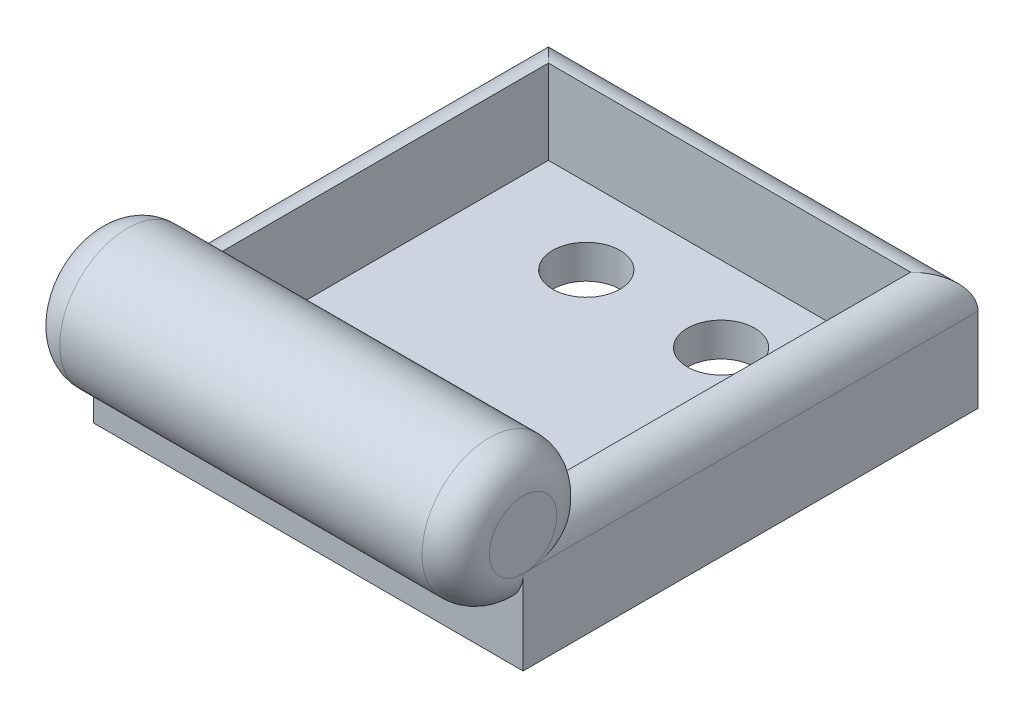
ISO-10303-21;
HEADER;
FILE_DESCRIPTION(('STEP AP214'),'2;1');
FILE_NAME('part.step','',(''),(''),'','','');
FILE_SCHEMA(('AUTOMOTIVE_DESIGN { 1 0 10303 214 1 1 1 1 }'));
ENDSEC;
DATA;
#1=APPLICATION_CONTEXT('core data for automotive mechanical design processes');
#2=APPLICATION_PROTOCOL_DEFINITION('international standard','automotive_design',2000,#1);
#3=PRODUCT_CONTEXT('',#1,'mechanical');
#4=PRODUCT('Part','Part','',(#3));
#5=PRODUCT_RELATED_PRODUCT_CATEGORY('part','',(#4));
#6=PRODUCT_DEFINITION_FORMATION('','',#4);
#7=PRODUCT_DEFINITION_CONTEXT('part definition',#1,'design');
#8=PRODUCT_DEFINITION('design','',#6,#7);
#9=PRODUCT_DEFINITION_SHAPE('','',#8);
#10=(LENGTH_UNIT() NAMED_UNIT(*) SI_UNIT(.MILLI.,.METRE.));
#11=(NAMED_UNIT(*) PLANE_ANGLE_UNIT() SI_UNIT($,.RADIAN.));
#12=(NAMED_UNIT(*) SI_UNIT($,.STERADIAN.) SOLID_ANGLE_UNIT());
#13=UNCERTAINTY_MEASURE_WITH_UNIT(LENGTH_MEASURE(1.E-05),#10,'distance_accuracy_value','');
#14=(GEOMETRIC_REPRESENTATION_CONTEXT(3) GLOBAL_UNCERTAINTY_ASSIGNED_CONTEXT((#13)) GLOBAL_UNIT_ASSIGNED_CONTEXT((#10,
#11,#12)) REPRESENTATION_CONTEXT('',''));
#15=CARTESIAN_POINT('',(0.,0.,0.));
#16=DIRECTION('',(0.,0.,1.));
#17=DIRECTION('',(1.,0.,0.));
#18=AXIS2_PLACEMENT_3D('',#15,#16,#17);
#19=CARTESIAN_POINT('',(12.75,7.,-13.5));
#20=DIRECTION('',(-1.,0.,0.));
#21=DIRECTION('',(0.,0.,1.));
#22=AXIS2_PLACEMENT_3D('',#19,#20,#21);
#23=PLANE('',#22);
#24=CARTESIAN_POINT('',(12.75,7.,13.5));
#25=DIRECTION('',(-1.,0.,0.));
#26=DIRECTION('',(0.,0.,1.));
#27=AXIS2_PLACEMENT_3D('',#24,#25,#26);
#28=CIRCLE('',#27,2.);
#29=CARTESIAN_POINT('',(12.75,5.,13.4999970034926));
#30=VERTEX_POINT('',#29);
#31=EDGE_CURVE('E209',#30,#30,#28,.F.);
#32=ORIENTED_EDGE('',*,*,#31,.T.);
#33=EDGE_LOOP('',(#32));
#34=FACE_BOUND('',#33,.T.);
#35=ADVANCED_FACE('F33',(#34),#23,.F.);
#36=CARTESIAN_POINT('',(-12.75,7.,-13.5));
#37=DIRECTION('',(1.,0.,0.));
#38=DIRECTION('',(0.,0.,-1.));
#39=AXIS2_PLACEMENT_3D('',#36,#37,#38);
#40=PLANE('',#39);
#41=DIRECTION('',(0.,-1.,0.));
#42=VECTOR('',#41,1.);
#43=CARTESIAN_POINT('',(-12.75,7.,13.5));
#44=LINE('',#43,#42);
#45=CARTESIAN_POINT('',(-12.75,5.,13.4999970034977));
#46=VERTEX_POINT('',#45);
#47=CARTESIAN_POINT('',(-12.75,0.,13.5));
#48=VERTEX_POINT('',#47);
#49=EDGE_CURVE('E301',#46,#48,#44,.T.);
#50=ORIENTED_EDGE('',*,*,#49,.F.);
#51=DIRECTION('',(0.,0.,1.));
#52=VECTOR('',#51,1.);
#53=CARTESIAN_POINT('',(-12.75,5.,-13.5));
#54=LINE('',#53,#52);
#55=CARTESIAN_POINT('',(-12.75,5.,-13.5));
#56=VERTEX_POINT('',#55);
#57=EDGE_CURVE('E201',#46,#56,#54,.F.);
#58=ORIENTED_EDGE('',*,*,#57,.T.);
#59=DIRECTION('',(0.,-1.,0.));
#60=VECTOR('',#59,1.);
#61=CARTESIAN_POINT('',(-12.75,7.,-13.5));
#62=LINE('',#61,#60);
#63=CARTESIAN_POINT('',(-12.75,0.,-13.5));
#64=VERTEX_POINT('',#63);
#65=EDGE_CURVE('E303',#56,#64,#62,.T.);
#66=ORIENTED_EDGE('',*,*,#65,.T.);
#67=DIRECTION('',(0.,0.,1.));
#68=VECTOR('',#67,1.);
#69=CARTESIAN_POINT('',(-12.75,0.,-13.5));
#70=LINE('',#69,#68);
#71=EDGE_CURVE('E295',#64,#48,#70,.T.);
#72=ORIENTED_EDGE('',*,*,#71,.T.);
#73=EDGE_LOOP('',(#50,#58,#66,#72));
#74=FACE_BOUND('',#73,.T.);
#75=ADVANCED_FACE('F248',(#74),#40,.F.);
#76=DIRECTION('',(0.,0.,-1.));
#77=VECTOR('',#76,1.);
#78=CARTESIAN_POINT('',(12.75,5.,9.5));
#79=LINE('',#78,#77);
#80=CARTESIAN_POINT('',(12.75,5.,-13.5));
#81=VERTEX_POINT('',#80);
#82=EDGE_CURVE('E206',#81,#30,#79,.F.);
#83=ORIENTED_EDGE('',*,*,#82,.T.);
#84=DIRECTION('',(0.,-1.,0.));
#85=VECTOR('',#84,1.);
#86=CARTESIAN_POINT('',(12.75,7.,13.5));
#87=LINE('',#86,#85);
#88=CARTESIAN_POINT('',(12.75,0.,13.5));
#89=VERTEX_POINT('',#88);
#90=EDGE_CURVE('E53',#30,#89,#87,.T.);
#91=ORIENTED_EDGE('',*,*,#90,.T.);
#92=DIRECTION('',(0.,0.,-1.));
#93=VECTOR('',#92,1.);
#94=CARTESIAN_POINT('',(12.75,0.,-13.5));
#95=LINE('',#94,#93);
#96=CARTESIAN_POINT('',(12.75,0.,-13.5));
#97=VERTEX_POINT('',#96);
#98=EDGE_CURVE('E289',#89,#97,#95,.T.);
#99=ORIENTED_EDGE('',*,*,#98,.T.);
#100=DIRECTION('',(0.,-1.,0.));
#101=VECTOR('',#100,1.);
#102=CARTESIAN_POINT('',(12.75,7.,-13.5));
#103=LINE('',#102,#101);
#104=EDGE_CURVE('E267',#81,#97,#103,.T.);
#105=ORIENTED_EDGE('',*,*,#104,.F.);
#106=EDGE_LOOP('',(#83,#91,#99,#105));
#107=FACE_BOUND('',#106,.T.);
#108=ADVANCED_FACE('F250',(#107),#23,.F.);
#109=CARTESIAN_POINT('',(-12.75,7.,-13.5));
#110=DIRECTION('',(0.,0.,1.));
#111=DIRECTION('',(1.,0.,0.));
#112=AXIS2_PLACEMENT_3D('',#109,#110,#111);
#113=PLANE('',#112);
#114=ORIENTED_EDGE('',*,*,#65,.F.);
#115=DIRECTION('',(-1.,0.,0.));
#116=VECTOR('',#115,1.);
#117=CARTESIAN_POINT('',(12.75,5.,-13.5));
#118=LINE('',#117,#116);
#119=EDGE_CURVE('E61',#56,#81,#118,.F.);
#120=ORIENTED_EDGE('',*,*,#119,.T.);
#121=ORIENTED_EDGE('',*,*,#104,.T.);
#122=DIRECTION('',(-1.,0.,0.));
#123=VECTOR('',#122,1.);
#124=CARTESIAN_POINT('',(-12.75,0.,-13.5));
#125=LINE('',#124,#123);
#126=EDGE_CURVE('E291',#97,#64,#125,.T.);
#127=ORIENTED_EDGE('',*,*,#126,.T.);
#128=EDGE_LOOP('',(#114,#120,#121,#127));
#129=FACE_BOUND('',#128,.T.);
#130=ADVANCED_FACE('F259',(#129),#113,.F.);
#131=CARTESIAN_POINT('',(-12.75,7.,13.5));
#132=DIRECTION('',(1.,0.,0.));
#133=DIRECTION('',(0.,0.,-1.));
#134=AXIS2_PLACEMENT_3D('',#131,#132,#133);
#135=CIRCLE('',#134,2.);
#136=EDGE_CURVE('E203',#46,#46,#135,.F.);
#137=ORIENTED_EDGE('',*,*,#136,.T.);
#138=EDGE_LOOP('',(#137));
#139=FACE_BOUND('',#138,.T.);
#140=ADVANCED_FACE('F256',(#139),#40,.F.);
#141=CARTESIAN_POINT('',(-12.75,7.,13.5));
#142=DIRECTION('',(0.,0.,-1.));
#143=DIRECTION('',(-1.,0.,0.));
#144=AXIS2_PLACEMENT_3D('',#141,#142,#143);
#145=PLANE('',#144);
#146=ORIENTED_EDGE('',*,*,#90,.F.);
#147=CARTESIAN_POINT('',(10.75,5.,13.5));
#148=DIRECTION('',(0.,0.,-1.));
#149=DIRECTION('',(-1.,0.,0.));
#150=AXIS2_PLACEMENT_3D('',#147,#148,#149);
#151=CIRCLE('',#150,2.);
#152=CARTESIAN_POINT('',(10.75,3.,13.5));
#153=VERTEX_POINT('',#152);
#154=EDGE_CURVE('E11',#30,#153,#151,.T.);
#155=ORIENTED_EDGE('',*,*,#154,.T.);
#156=DIRECTION('',(1.,0.,0.));
#157=VECTOR('',#156,1.);
#158=CARTESIAN_POINT('',(-12.75,3.,13.5));
#159=LINE('',#158,#157);
#160=CARTESIAN_POINT('',(-10.75,3.,13.5));
#161=VERTEX_POINT('',#160);
#162=EDGE_CURVE('E413',#153,#161,#159,.F.);
#163=ORIENTED_EDGE('',*,*,#162,.T.);
#164=CARTESIAN_POINT('',(-10.75,5.,13.5));
#165=DIRECTION('',(0.,0.,-1.));
#166=DIRECTION('',(-1.,0.,0.));
#167=AXIS2_PLACEMENT_3D('',#164,#165,#166);
#168=CIRCLE('',#167,2.);
#169=EDGE_CURVE('E46',#161,#46,#168,.T.);
#170=ORIENTED_EDGE('',*,*,#169,.T.);
#171=ORIENTED_EDGE('',*,*,#49,.T.);
#172=DIRECTION('',(1.,0.,0.));
#173=VECTOR('',#172,1.);
#174=CARTESIAN_POINT('',(-12.75,0.,13.5));
#175=LINE('',#174,#173);
#176=EDGE_CURVE('E298',#48,#89,#175,.T.);
#177=ORIENTED_EDGE('',*,*,#176,.T.);
#178=EDGE_LOOP('',(#146,#155,#163,#170,#171,#177));
#179=FACE_BOUND('',#178,.T.);
#180=ADVANCED_FACE('F401',(#179),#145,.F.);
#181=CARTESIAN_POINT('',(0.,0.,0.));
#182=DIRECTION('',(0.,1.,0.));
#183=DIRECTION('',(0.,0.,1.));
#184=AXIS2_PLACEMENT_3D('',#181,#182,#183);
#185=PLANE('',#184);
#186=CARTESIAN_POINT('',(-4.,0.,-7.));
#187=DIRECTION('',(0.,1.,0.));
#188=DIRECTION('',(0.,0.,1.));
#189=AXIS2_PLACEMENT_3D('',#186,#187,#188);
#190=CIRCLE('',#189,2.);
#191=CARTESIAN_POINT('',(-4.,0.,-5.));
#192=VERTEX_POINT('',#191);
#193=EDGE_CURVE('E223',#192,#192,#190,.T.);
#194=ORIENTED_EDGE('',*,*,#193,.T.);
#195=EDGE_LOOP('',(#194));
#196=FACE_BOUND('',#195,.T.);
#197=CARTESIAN_POINT('',(3.99999999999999,0.,-7.));
#198=DIRECTION('',(0.,1.,0.));
#199=DIRECTION('',(0.,0.,-1.));
#200=AXIS2_PLACEMENT_3D('',#197,#198,#199);
#201=CIRCLE('',#200,2.);
#202=CARTESIAN_POINT('',(3.99999999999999,0.,-9.));
#203=VERTEX_POINT('',#202);
#204=EDGE_CURVE('E628',#203,#203,#201,.T.);
#205=ORIENTED_EDGE('',*,*,#204,.T.);
#206=EDGE_LOOP('',(#205));
#207=FACE_BOUND('',#206,.T.);
#208=DIRECTION('',(0.,0.,1.));
#209=VECTOR('',#208,1.);
#210=CARTESIAN_POINT('',(10.5,0.,9.5));
#211=LINE('',#210,#209);
#212=CARTESIAN_POINT('',(10.5,0.,7.5));
#213=VERTEX_POINT('',#212);
#214=CARTESIAN_POINT('',(10.5,0.,9.5));
#215=VERTEX_POINT('',#214);
#216=EDGE_CURVE('E416',#213,#215,#211,.T.);
#217=ORIENTED_EDGE('',*,*,#216,.F.);
#218=CARTESIAN_POINT('',(9.5,0.,7.5));
#219=DIRECTION('',(0.,-1.,0.));
#220=DIRECTION('',(0.,0.,-1.));
#221=AXIS2_PLACEMENT_3D('',#218,#219,#220);
#222=CIRCLE('',#221,1.);
#223=CARTESIAN_POINT('',(9.5,0.,6.5));
#224=VERTEX_POINT('',#223);
#225=EDGE_CURVE('E414',#224,#213,#222,.T.);
#226=ORIENTED_EDGE('',*,*,#225,.F.);
#227=DIRECTION('',(1.,0.,0.));
#228=VECTOR('',#227,1.);
#229=CARTESIAN_POINT('',(-9.5,0.,6.5));
#230=LINE('',#229,#228);
#231=CARTESIAN_POINT('',(-9.5,0.,6.5));
#232=VERTEX_POINT('',#231);
#233=EDGE_CURVE('E367',#232,#224,#230,.T.);
#234=ORIENTED_EDGE('',*,*,#233,.F.);
#235=CARTESIAN_POINT('',(-9.5,0.,7.5));
#236=DIRECTION('',(0.,-1.,0.));
#237=DIRECTION('',(0.,0.,-1.));
#238=AXIS2_PLACEMENT_3D('',#235,#236,#237);
#239=CIRCLE('',#238,1.);
#240=CARTESIAN_POINT('',(-10.5,0.,7.5));
#241=VERTEX_POINT('',#240);
#242=EDGE_CURVE('E334',#241,#232,#239,.T.);
#243=ORIENTED_EDGE('',*,*,#242,.F.);
#244=DIRECTION('',(0.,0.,-1.));
#245=VECTOR('',#244,1.);
#246=CARTESIAN_POINT('',(-10.5,0.,9.5));
#247=LINE('',#246,#245);
#248=CARTESIAN_POINT('',(-10.5,0.,9.5));
#249=VERTEX_POINT('',#248);
#250=EDGE_CURVE('E429',#249,#241,#247,.T.);
#251=ORIENTED_EDGE('',*,*,#250,.F.);
#252=CARTESIAN_POINT('',(-9.5,0.,9.5));
#253=DIRECTION('',(0.,-1.,0.));
#254=DIRECTION('',(0.,0.,-1.));
#255=AXIS2_PLACEMENT_3D('',#252,#253,#254);
#256=CIRCLE('',#255,1.);
#257=CARTESIAN_POINT('',(-9.5,0.,10.5));
#258=VERTEX_POINT('',#257);
#259=EDGE_CURVE('E353',#258,#249,#256,.T.);
#260=ORIENTED_EDGE('',*,*,#259,.F.);
#261=DIRECTION('',(-1.,0.,0.));
#262=VECTOR('',#261,1.);
#263=CARTESIAN_POINT('',(-9.5,0.,10.5));
#264=LINE('',#263,#262);
#265=CARTESIAN_POINT('',(9.5,0.,10.5));
#266=VERTEX_POINT('',#265);
#267=EDGE_CURVE('E425',#266,#258,#264,.T.);
#268=ORIENTED_EDGE('',*,*,#267,.F.);
#269=CARTESIAN_POINT('',(9.5,0.,9.5));
#270=DIRECTION('',(0.,-1.,0.));
#271=DIRECTION('',(0.,0.,1.));
#272=AXIS2_PLACEMENT_3D('',#269,#270,#271);
#273=CIRCLE('',#272,1.);
#274=EDGE_CURVE('E422',#215,#266,#273,.T.);
#275=ORIENTED_EDGE('',*,*,#274,.F.);
#276=EDGE_LOOP('',(#217,#226,#234,#243,#251,#260,#268,#275));
#277=FACE_BOUND('',#276,.T.);
#278=ORIENTED_EDGE('',*,*,#98,.F.);
#279=ORIENTED_EDGE('',*,*,#176,.F.);
#280=ORIENTED_EDGE('',*,*,#71,.F.);
#281=ORIENTED_EDGE('',*,*,#126,.F.);
#282=EDGE_LOOP('',(#278,#279,#280,#281));
#283=FACE_BOUND('',#282,.T.);
#284=ADVANCED_FACE('F389',(#196,#207,#277,#283),#185,.F.);
#285=CARTESIAN_POINT('',(10.75,7.,-13.5));
#286=DIRECTION('',(-1.,0.,0.));
#287=DIRECTION('',(0.,0.,1.));
#288=AXIS2_PLACEMENT_3D('',#285,#286,#287);
#289=PLANE('',#288);
#290=CARTESIAN_POINT('',(10.75,7.,13.5));
#291=DIRECTION('',(-1.,0.,0.));
#292=DIRECTION('',(0.,0.,1.));
#293=AXIS2_PLACEMENT_3D('',#290,#291,#292);
#294=CIRCLE('',#293,4.);
#295=CARTESIAN_POINT('',(10.75,7.,9.5));
#296=VERTEX_POINT('',#295);
#297=CARTESIAN_POINT('',(10.75,3.53589838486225,11.5));
#298=VERTEX_POINT('',#297);
#299=EDGE_CURVE('E186',#296,#298,#294,.T.);
#300=ORIENTED_EDGE('',*,*,#299,.F.);
#301=DIRECTION('',(0.,0.,-1.));
#302=VECTOR('',#301,1.);
#303=CARTESIAN_POINT('',(10.75,7.,-13.5));
#304=LINE('',#303,#302);
#305=CARTESIAN_POINT('',(10.75,7.,-11.5));
#306=VERTEX_POINT('',#305);
#307=EDGE_CURVE('E274',#296,#306,#304,.T.);
#308=ORIENTED_EDGE('',*,*,#307,.T.);
#309=DIRECTION('',(0.,-1.,0.));
#310=VECTOR('',#309,1.);
#311=CARTESIAN_POINT('',(10.75,7.,-11.5));
#312=LINE('',#311,#310);
#313=CARTESIAN_POINT('',(10.75,2.,-11.5));
#314=VERTEX_POINT('',#313);
#315=EDGE_CURVE('E292',#306,#314,#312,.T.);
#316=ORIENTED_EDGE('',*,*,#315,.T.);
#317=DIRECTION('',(0.,0.,-1.));
#318=VECTOR('',#317,1.);
#319=CARTESIAN_POINT('',(10.75,2.,-13.5));
#320=LINE('',#319,#318);
#321=CARTESIAN_POINT('',(10.75,2.,11.5));
#322=VERTEX_POINT('',#321);
#323=EDGE_CURVE('E368',#322,#314,#320,.T.);
#324=ORIENTED_EDGE('',*,*,#323,.F.);
#325=DIRECTION('',(0.,-1.,0.));
#326=VECTOR('',#325,1.);
#327=CARTESIAN_POINT('',(10.75,7.,11.5));
#328=LINE('',#327,#326);
#329=EDGE_CURVE('E175',#298,#322,#328,.T.);
#330=ORIENTED_EDGE('',*,*,#329,.F.);
#331=EDGE_LOOP('',(#300,#308,#316,#324,#330));
#332=FACE_BOUND('',#331,.T.);
#333=ADVANCED_FACE('F380',(#332),#289,.T.);
#334=CARTESIAN_POINT('',(-12.75,7.,-11.5));
#335=DIRECTION('',(0.,0.,1.));
#336=DIRECTION('',(1.,0.,0.));
#337=AXIS2_PLACEMENT_3D('',#334,#335,#336);
#338=PLANE('',#337);
#339=DIRECTION('',(-1.,0.,0.));
#340=VECTOR('',#339,1.);
#341=CARTESIAN_POINT('',(-12.75,2.,-11.5));
#342=LINE('',#341,#340);
#343=CARTESIAN_POINT('',(-10.75,2.,-11.5));
#344=VERTEX_POINT('',#343);
#345=EDGE_CURVE('E371',#314,#344,#342,.T.);
#346=ORIENTED_EDGE('',*,*,#345,.F.);
#347=ORIENTED_EDGE('',*,*,#315,.F.);
#348=DIRECTION('',(-1.,0.,0.));
#349=VECTOR('',#348,1.);
#350=CARTESIAN_POINT('',(-12.75,7.,-11.5));
#351=LINE('',#350,#349);
#352=CARTESIAN_POINT('',(-10.75,7.,-11.5));
#353=VERTEX_POINT('',#352);
#354=EDGE_CURVE('E280',#306,#353,#351,.T.);
#355=ORIENTED_EDGE('',*,*,#354,.T.);
#356=DIRECTION('',(0.,-1.,0.));
#357=VECTOR('',#356,1.);
#358=CARTESIAN_POINT('',(-10.75,7.,-11.5));
#359=LINE('',#358,#357);
#360=EDGE_CURVE('E174',#353,#344,#359,.T.);
#361=ORIENTED_EDGE('',*,*,#360,.T.);
#362=EDGE_LOOP('',(#346,#347,#355,#361));
#363=FACE_BOUND('',#362,.T.);
#364=ADVANCED_FACE('F381',(#363),#338,.T.);
#365=CARTESIAN_POINT('',(-10.75,7.,-13.5));
#366=DIRECTION('',(1.,0.,0.));
#367=DIRECTION('',(0.,0.,-1.));
#368=AXIS2_PLACEMENT_3D('',#365,#366,#367);
#369=PLANE('',#368);
#370=CARTESIAN_POINT('',(-10.75,7.,13.5));
#371=DIRECTION('',(1.,0.,0.));
#372=DIRECTION('',(0.,0.,-1.));
#373=AXIS2_PLACEMENT_3D('',#370,#371,#372);
#374=CIRCLE('',#373,4.);
#375=CARTESIAN_POINT('',(-10.75,3.53589838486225,11.5));
#376=VERTEX_POINT('',#375);
#377=CARTESIAN_POINT('',(-10.75,7.,9.5));
#378=VERTEX_POINT('',#377);
#379=EDGE_CURVE('E178',#376,#378,#374,.T.);
#380=ORIENTED_EDGE('',*,*,#379,.F.);
#381=DIRECTION('',(0.,-1.,0.));
#382=VECTOR('',#381,1.);
#383=CARTESIAN_POINT('',(-10.75,7.,11.5));
#384=LINE('',#383,#382);
#385=CARTESIAN_POINT('',(-10.75,2.,11.5));
#386=VERTEX_POINT('',#385);
#387=EDGE_CURVE('E163',#376,#386,#384,.T.);
#388=ORIENTED_EDGE('',*,*,#387,.T.);
#389=DIRECTION('',(0.,0.,1.));
#390=VECTOR('',#389,1.);
#391=CARTESIAN_POINT('',(-10.75,2.,-13.5));
#392=LINE('',#391,#390);
#393=EDGE_CURVE('E376',#344,#386,#392,.T.);
#394=ORIENTED_EDGE('',*,*,#393,.F.);
#395=ORIENTED_EDGE('',*,*,#360,.F.);
#396=DIRECTION('',(0.,0.,1.));
#397=VECTOR('',#396,1.);
#398=CARTESIAN_POINT('',(-10.75,7.,-13.5));
#399=LINE('',#398,#397);
#400=EDGE_CURVE('E182',#353,#378,#399,.T.);
#401=ORIENTED_EDGE('',*,*,#400,.T.);
#402=EDGE_LOOP('',(#380,#388,#394,#395,#401));
#403=FACE_BOUND('',#402,.T.);
#404=ADVANCED_FACE('F179',(#403),#369,.T.);
#405=CARTESIAN_POINT('',(-12.75,7.,11.5));
#406=DIRECTION('',(0.,0.,-1.));
#407=DIRECTION('',(-1.,0.,0.));
#408=AXIS2_PLACEMENT_3D('',#405,#406,#407);
#409=PLANE('',#408);
#410=DIRECTION('',(1.,0.,0.));
#411=VECTOR('',#410,1.);
#412=CARTESIAN_POINT('',(-12.75,3.53589838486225,11.5));
#413=LINE('',#412,#411);
#414=EDGE_CURVE('E167',#298,#376,#413,.F.);
#415=ORIENTED_EDGE('',*,*,#414,.F.);
#416=ORIENTED_EDGE('',*,*,#329,.T.);
#417=DIRECTION('',(1.,0.,0.));
#418=VECTOR('',#417,1.);
#419=CARTESIAN_POINT('',(-12.75,2.,11.5));
#420=LINE('',#419,#418);
#421=EDGE_CURVE('E170',#386,#322,#420,.T.);
#422=ORIENTED_EDGE('',*,*,#421,.F.);
#423=ORIENTED_EDGE('',*,*,#387,.F.);
#424=EDGE_LOOP('',(#415,#416,#422,#423));
#425=FACE_BOUND('',#424,.T.);
#426=ADVANCED_FACE('F165',(#425),#409,.T.);
#427=CARTESIAN_POINT('',(0.,2.,0.));
#428=DIRECTION('',(0.,1.,0.));
#429=DIRECTION('',(0.,0.,1.));
#430=AXIS2_PLACEMENT_3D('',#427,#428,#429);
#431=PLANE('',#430);
#432=CARTESIAN_POINT('',(-4.,2.,-7.));
#433=DIRECTION('',(0.,1.,0.));
#434=DIRECTION('',(0.,0.,1.));
#435=AXIS2_PLACEMENT_3D('',#432,#433,#434);
#436=CIRCLE('',#435,2.);
#437=CARTESIAN_POINT('',(-4.,2.,-5.));
#438=VERTEX_POINT('',#437);
#439=EDGE_CURVE('E627',#438,#438,#436,.T.);
#440=ORIENTED_EDGE('',*,*,#439,.F.);
#441=EDGE_LOOP('',(#440));
#442=FACE_BOUND('',#441,.T.);
#443=CARTESIAN_POINT('',(3.99999999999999,2.,-7.));
#444=DIRECTION('',(0.,1.,0.));
#445=DIRECTION('',(0.,0.,-1.));
#446=AXIS2_PLACEMENT_3D('',#443,#444,#445);
#447=CIRCLE('',#446,2.);
#448=CARTESIAN_POINT('',(3.99999999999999,2.,-9.));
#449=VERTEX_POINT('',#448);
#450=EDGE_CURVE('E632',#449,#449,#447,.T.);
#451=ORIENTED_EDGE('',*,*,#450,.F.);
#452=EDGE_LOOP('',(#451));
#453=FACE_BOUND('',#452,.T.);
#454=CARTESIAN_POINT('',(9.5,2.,7.5));
#455=DIRECTION('',(0.,1.,0.));
#456=DIRECTION('',(0.,0.,1.));
#457=AXIS2_PLACEMENT_3D('',#454,#455,#456);
#458=CIRCLE('',#457,1.);
#459=CARTESIAN_POINT('',(10.5,2.,7.5));
#460=VERTEX_POINT('',#459);
#461=CARTESIAN_POINT('',(9.5,2.,6.5));
#462=VERTEX_POINT('',#461);
#463=EDGE_CURVE('E192',#460,#462,#458,.T.);
#464=ORIENTED_EDGE('',*,*,#463,.F.);
#465=DIRECTION('',(0.,0.,-1.));
#466=VECTOR('',#465,1.);
#467=CARTESIAN_POINT('',(10.5,2.,0.));
#468=LINE('',#467,#466);
#469=CARTESIAN_POINT('',(10.5,2.,9.5));
#470=VERTEX_POINT('',#469);
#471=EDGE_CURVE('E306',#470,#460,#468,.T.);
#472=ORIENTED_EDGE('',*,*,#471,.F.);
#473=CARTESIAN_POINT('',(9.5,2.,9.5));
#474=DIRECTION('',(0.,1.,0.));
#475=DIRECTION('',(0.,0.,1.));
#476=AXIS2_PLACEMENT_3D('',#473,#474,#475);
#477=CIRCLE('',#476,1.);
#478=CARTESIAN_POINT('',(9.5,2.,10.5));
#479=VERTEX_POINT('',#478);
#480=EDGE_CURVE('E308',#479,#470,#477,.T.);
#481=ORIENTED_EDGE('',*,*,#480,.F.);
#482=DIRECTION('',(1.,0.,0.));
#483=VECTOR('',#482,1.);
#484=CARTESIAN_POINT('',(0.,2.,10.5));
#485=LINE('',#484,#483);
#486=CARTESIAN_POINT('',(-9.5,2.,10.5));
#487=VERTEX_POINT('',#486);
#488=EDGE_CURVE('E311',#487,#479,#485,.T.);
#489=ORIENTED_EDGE('',*,*,#488,.F.);
#490=CARTESIAN_POINT('',(-9.5,2.,9.5));
#491=DIRECTION('',(0.,1.,0.));
#492=DIRECTION('',(0.,0.,1.));
#493=AXIS2_PLACEMENT_3D('',#490,#491,#492);
#494=CIRCLE('',#493,1.);
#495=CARTESIAN_POINT('',(-10.5,2.,9.5));
#496=VERTEX_POINT('',#495);
#497=EDGE_CURVE('E313',#496,#487,#494,.T.);
#498=ORIENTED_EDGE('',*,*,#497,.F.);
#499=DIRECTION('',(0.,0.,1.));
#500=VECTOR('',#499,1.);
#501=CARTESIAN_POINT('',(-10.5,2.,0.));
#502=LINE('',#501,#500);
#503=CARTESIAN_POINT('',(-10.5,2.,7.5));
#504=VERTEX_POINT('',#503);
#505=EDGE_CURVE('E315',#504,#496,#502,.T.);
#506=ORIENTED_EDGE('',*,*,#505,.F.);
#507=CARTESIAN_POINT('',(-9.5,2.,7.5));
#508=DIRECTION('',(0.,1.,0.));
#509=DIRECTION('',(0.,0.,1.));
#510=AXIS2_PLACEMENT_3D('',#507,#508,#509);
#511=CIRCLE('',#510,1.);
#512=CARTESIAN_POINT('',(-9.5,2.,6.5));
#513=VERTEX_POINT('',#512);
#514=EDGE_CURVE('E317',#513,#504,#511,.T.);
#515=ORIENTED_EDGE('',*,*,#514,.F.);
#516=DIRECTION('',(-1.,0.,0.));
#517=VECTOR('',#516,1.);
#518=CARTESIAN_POINT('',(0.,2.,6.5));
#519=LINE('',#518,#517);
#520=EDGE_CURVE('E196',#462,#513,#519,.T.);
#521=ORIENTED_EDGE('',*,*,#520,.F.);
#522=EDGE_LOOP('',(#464,#472,#481,#489,#498,#506,#515,#521));
#523=FACE_BOUND('',#522,.T.);
#524=ORIENTED_EDGE('',*,*,#323,.T.);
#525=ORIENTED_EDGE('',*,*,#345,.T.);
#526=ORIENTED_EDGE('',*,*,#393,.T.);
#527=ORIENTED_EDGE('',*,*,#421,.T.);
#528=EDGE_LOOP('',(#524,#525,#526,#527));
#529=FACE_BOUND('',#528,.T.);
#530=ADVANCED_FACE('F339',(#442,#453,#523,#529),#431,.T.);
#531=CARTESIAN_POINT('',(9.5,7.,7.5));
#532=DIRECTION('',(0.,-1.,0.));
#533=DIRECTION('',(0.,0.,-1.));
#534=AXIS2_PLACEMENT_3D('',#531,#532,#533);
#535=CYLINDRICAL_SURFACE('',#534,1.);
#536=ORIENTED_EDGE('',*,*,#463,.T.);
#537=DIRECTION('',(0.,-1.,0.));
#538=VECTOR('',#537,1.);
#539=CARTESIAN_POINT('',(9.5,7.,6.5));
#540=LINE('',#539,#538);
#541=EDGE_CURVE('E326',#462,#224,#540,.T.);
#542=ORIENTED_EDGE('',*,*,#541,.T.);
#543=ORIENTED_EDGE('',*,*,#225,.T.);
#544=DIRECTION('',(0.,-1.,0.));
#545=VECTOR('',#544,1.);
#546=CARTESIAN_POINT('',(10.5,7.,7.5));
#547=LINE('',#546,#545);
#548=EDGE_CURVE('E364',#460,#213,#547,.T.);
#549=ORIENTED_EDGE('',*,*,#548,.F.);
#550=EDGE_LOOP('',(#536,#542,#543,#549));
#551=FACE_BOUND('',#550,.T.);
#552=ADVANCED_FACE('F397',(#551),#535,.F.);
#553=CARTESIAN_POINT('',(-9.5,7.,6.5));
#554=DIRECTION('',(0.,0.,-1.));
#555=DIRECTION('',(-1.,0.,0.));
#556=AXIS2_PLACEMENT_3D('',#553,#554,#555);
#557=PLANE('',#556);
#558=ORIENTED_EDGE('',*,*,#520,.T.);
#559=DIRECTION('',(0.,-1.,0.));
#560=VECTOR('',#559,1.);
#561=CARTESIAN_POINT('',(-9.5,7.,6.5));
#562=LINE('',#561,#560);
#563=EDGE_CURVE('E324',#513,#232,#562,.T.);
#564=ORIENTED_EDGE('',*,*,#563,.T.);
#565=ORIENTED_EDGE('',*,*,#233,.T.);
#566=ORIENTED_EDGE('',*,*,#541,.F.);
#567=EDGE_LOOP('',(#558,#564,#565,#566));
#568=FACE_BOUND('',#567,.T.);
#569=ADVANCED_FACE('F322',(#568),#557,.F.);
#570=CARTESIAN_POINT('',(-9.5,7.,7.5));
#571=DIRECTION('',(0.,-1.,0.));
#572=DIRECTION('',(0.,0.,-1.));
#573=AXIS2_PLACEMENT_3D('',#570,#571,#572);
#574=CYLINDRICAL_SURFACE('',#573,1.);
#575=ORIENTED_EDGE('',*,*,#514,.T.);
#576=DIRECTION('',(0.,-1.,0.));
#577=VECTOR('',#576,1.);
#578=CARTESIAN_POINT('',(-10.5,7.,7.5));
#579=LINE('',#578,#577);
#580=EDGE_CURVE('E336',#504,#241,#579,.T.);
#581=ORIENTED_EDGE('',*,*,#580,.T.);
#582=ORIENTED_EDGE('',*,*,#242,.T.);
#583=ORIENTED_EDGE('',*,*,#563,.F.);
#584=EDGE_LOOP('',(#575,#581,#582,#583));
#585=FACE_BOUND('',#584,.T.);
#586=ADVANCED_FACE('F331',(#585),#574,.F.);
#587=CARTESIAN_POINT('',(-10.5,7.,9.5));
#588=DIRECTION('',(-1.,0.,0.));
#589=DIRECTION('',(0.,0.,1.));
#590=AXIS2_PLACEMENT_3D('',#587,#588,#589);
#591=PLANE('',#590);
#592=ORIENTED_EDGE('',*,*,#505,.T.);
#593=DIRECTION('',(0.,-1.,0.));
#594=VECTOR('',#593,1.);
#595=CARTESIAN_POINT('',(-10.5,7.,9.5));
#596=LINE('',#595,#594);
#597=EDGE_CURVE('E347',#496,#249,#596,.T.);
#598=ORIENTED_EDGE('',*,*,#597,.T.);
#599=ORIENTED_EDGE('',*,*,#250,.T.);
#600=ORIENTED_EDGE('',*,*,#580,.F.);
#601=EDGE_LOOP('',(#592,#598,#599,#600));
#602=FACE_BOUND('',#601,.T.);
#603=ADVANCED_FACE('F345',(#602),#591,.F.);
#604=CARTESIAN_POINT('',(-9.5,7.,9.5));
#605=DIRECTION('',(0.,-1.,0.));
#606=DIRECTION('',(0.,0.,-1.));
#607=AXIS2_PLACEMENT_3D('',#604,#605,#606);
#608=CYLINDRICAL_SURFACE('',#607,1.);
#609=ORIENTED_EDGE('',*,*,#497,.T.);
#610=DIRECTION('',(0.,-1.,0.));
#611=VECTOR('',#610,1.);
#612=CARTESIAN_POINT('',(-9.5,7.,10.5));
#613=LINE('',#612,#611);
#614=EDGE_CURVE('E355',#487,#258,#613,.T.);
#615=ORIENTED_EDGE('',*,*,#614,.T.);
#616=ORIENTED_EDGE('',*,*,#259,.T.);
#617=ORIENTED_EDGE('',*,*,#597,.F.);
#618=EDGE_LOOP('',(#609,#615,#616,#617));
#619=FACE_BOUND('',#618,.T.);
#620=ADVANCED_FACE('F350',(#619),#608,.F.);
#621=CARTESIAN_POINT('',(-9.5,7.,10.5));
#622=DIRECTION('',(0.,0.,1.));
#623=DIRECTION('',(1.,0.,0.));
#624=AXIS2_PLACEMENT_3D('',#621,#622,#623);
#625=PLANE('',#624);
#626=ORIENTED_EDGE('',*,*,#488,.T.);
#627=DIRECTION('',(0.,-1.,0.));
#628=VECTOR('',#627,1.);
#629=CARTESIAN_POINT('',(9.5,7.,10.5));
#630=LINE('',#629,#628);
#631=EDGE_CURVE('E358',#479,#266,#630,.T.);
#632=ORIENTED_EDGE('',*,*,#631,.T.);
#633=ORIENTED_EDGE('',*,*,#267,.T.);
#634=ORIENTED_EDGE('',*,*,#614,.F.);
#635=EDGE_LOOP('',(#626,#632,#633,#634));
#636=FACE_BOUND('',#635,.T.);
#637=ADVANCED_FACE('F448',(#636),#625,.F.);
#638=CARTESIAN_POINT('',(9.5,7.,9.5));
#639=DIRECTION('',(0.,-1.,0.));
#640=DIRECTION('',(0.,0.,-1.));
#641=AXIS2_PLACEMENT_3D('',#638,#639,#640);
#642=CYLINDRICAL_SURFACE('',#641,1.);
#643=ORIENTED_EDGE('',*,*,#480,.T.);
#644=DIRECTION('',(0.,-1.,0.));
#645=VECTOR('',#644,1.);
#646=CARTESIAN_POINT('',(10.5,7.,9.5));
#647=LINE('',#646,#645);
#648=EDGE_CURVE('E362',#470,#215,#647,.T.);
#649=ORIENTED_EDGE('',*,*,#648,.T.);
#650=ORIENTED_EDGE('',*,*,#274,.T.);
#651=ORIENTED_EDGE('',*,*,#631,.F.);
#652=EDGE_LOOP('',(#643,#649,#650,#651));
#653=FACE_BOUND('',#652,.T.);
#654=ADVANCED_FACE('F446',(#653),#642,.F.);
#655=CARTESIAN_POINT('',(10.5,7.,9.5));
#656=DIRECTION('',(1.,0.,0.));
#657=DIRECTION('',(0.,0.,-1.));
#658=AXIS2_PLACEMENT_3D('',#655,#656,#657);
#659=PLANE('',#658);
#660=ORIENTED_EDGE('',*,*,#471,.T.);
#661=ORIENTED_EDGE('',*,*,#548,.T.);
#662=ORIENTED_EDGE('',*,*,#216,.T.);
#663=ORIENTED_EDGE('',*,*,#648,.F.);
#664=EDGE_LOOP('',(#660,#661,#662,#663));
#665=FACE_BOUND('',#664,.T.);
#666=ADVANCED_FACE('F244',(#665),#659,.F.);
#667=CARTESIAN_POINT('',(-12.75,7.,13.5));
#668=DIRECTION('',(1.,0.,0.));
#669=DIRECTION('',(0.,0.,-1.));
#670=AXIS2_PLACEMENT_3D('',#667,#668,#669);
#671=CYLINDRICAL_SURFACE('',#670,4.);
#672=ORIENTED_EDGE('',*,*,#379,.T.);
#673=CARTESIAN_POINT('',(-10.75,7.,13.5));
#674=DIRECTION('',(1.,0.,0.));
#675=DIRECTION('',(0.,0.,-1.));
#676=AXIS2_PLACEMENT_3D('',#673,#674,#675);
#677=CIRCLE('',#676,4.);
#678=EDGE_CURVE('E194',#378,#161,#677,.T.);
#679=ORIENTED_EDGE('',*,*,#678,.T.);
#680=ORIENTED_EDGE('',*,*,#162,.F.);
#681=CARTESIAN_POINT('',(10.75,7.,13.5));
#682=DIRECTION('',(-1.,0.,0.));
#683=DIRECTION('',(0.,0.,1.));
#684=AXIS2_PLACEMENT_3D('',#681,#682,#683);
#685=CIRCLE('',#684,4.);
#686=EDGE_CURVE('E191',#153,#296,#685,.T.);
#687=ORIENTED_EDGE('',*,*,#686,.T.);
#688=ORIENTED_EDGE('',*,*,#299,.T.);
#689=ORIENTED_EDGE('',*,*,#414,.T.);
#690=EDGE_LOOP('',(#672,#679,#680,#687,#688,#689));
#691=FACE_BOUND('',#690,.T.);
#692=ADVANCED_FACE('F189',(#691),#671,.T.);
#693=CARTESIAN_POINT('',(10.75,7.,13.5));
#694=DIRECTION('',(-1.,0.,0.));
#695=DIRECTION('',(0.,0.,1.));
#696=AXIS2_PLACEMENT_3D('',#693,#694,#695);
#697=TOROIDAL_SURFACE('',#696,2.,2.);
#698=ORIENTED_EDGE('',*,*,#154,.F.);
#699=ORIENTED_EDGE('',*,*,#31,.F.);
#700=CARTESIAN_POINT('',(10.75,7.,9.5));
#701=CARTESIAN_POINT('',(10.7937931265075,7.00001030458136,9.49999289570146));
#702=CARTESIAN_POINT('',(10.837579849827,6.99856193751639,9.50143813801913));
#703=CARTESIAN_POINT('',(10.92475455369,6.9928263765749,9.50717818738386));
#704=CARTESIAN_POINT('',(10.9681427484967,6.98854081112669,9.51147135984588));
#705=CARTESIAN_POINT('',(11.0538857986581,6.97724867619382,9.52281261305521));
#706=CARTESIAN_POINT('',(11.0962457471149,6.97026127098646,9.52984129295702));
#707=CARTESIAN_POINT('',(11.1799178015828,6.95371249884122,9.54654966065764));
#708=CARTESIAN_POINT('',(11.2212298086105,6.94415088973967,9.55622959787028));
#709=CARTESIAN_POINT('',(11.3429995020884,6.9119021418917,9.58902843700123));
#710=CARTESIAN_POINT('',(11.4215389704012,6.88561698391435,9.61594002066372));
#711=CARTESIAN_POINT('',(11.5717520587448,6.82518912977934,9.6786788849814));
#712=CARTESIAN_POINT('',(11.6434136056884,6.79103296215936,9.71452145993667));
#713=CARTESIAN_POINT('',(11.8009830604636,6.70467058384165,9.8067476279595));
#714=CARTESIAN_POINT('',(11.8839636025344,6.65020434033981,9.86602218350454));
#715=CARTESIAN_POINT('',(12.0358401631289,6.53484665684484,9.99529334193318));
#716=CARTESIAN_POINT('',(12.1047143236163,6.47394546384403,10.0653062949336));
#717=CARTESIAN_POINT('',(12.2531674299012,6.32492472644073,10.2427041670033));
#718=CARTESIAN_POINT('',(12.3265627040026,6.23539803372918,10.3540618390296));
#719=CARTESIAN_POINT('',(12.4511417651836,6.05734127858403,10.589220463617));
#720=CARTESIAN_POINT('',(12.5022819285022,5.9688135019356,10.7130452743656));
#721=CARTESIAN_POINT('',(12.5999149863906,5.7704679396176,11.0115247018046));
#722=CARTESIAN_POINT('',(12.6397317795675,5.66285745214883,11.1898013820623));
#723=CARTESIAN_POINT('',(12.697540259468,5.46645352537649,11.5594368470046));
#724=CARTESIAN_POINT('',(12.7155422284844,5.37765123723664,11.7507894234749));
#725=CARTESIAN_POINT('',(12.7329145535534,5.26362199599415,12.0445040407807));
#726=CARTESIAN_POINT('',(12.7371028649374,5.22893300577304,12.143019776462));
#727=CARTESIAN_POINT('',(12.7433217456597,5.16631365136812,12.3422344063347));
#728=CARTESIAN_POINT('',(12.745352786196,5.13838181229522,12.4429328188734));
#729=CARTESIAN_POINT('',(12.7484425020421,5.08440234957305,12.6689305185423));
#730=CARTESIAN_POINT('',(12.7491807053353,5.06018405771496,12.7946795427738));
#731=CARTESIAN_POINT('',(12.7497997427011,5.03042579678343,13.0003302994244));
#732=CARTESIAN_POINT('',(12.7498983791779,5.02128698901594,13.0797255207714));
#733=CARTESIAN_POINT('',(12.7499773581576,5.01036042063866,13.2080154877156));
#734=CARTESIAN_POINT('',(12.7499887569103,5.00709620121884,13.2567864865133));
#735=CARTESIAN_POINT('',(12.7499994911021,5.0026005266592,13.3492922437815));
#736=CARTESIAN_POINT('',(12.7499999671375,5.00119167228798,13.3930183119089));
#737=CARTESIAN_POINT('',(12.7499999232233,5.00016661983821,13.4578348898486));
#738=CARTESIAN_POINT('',(12.7499997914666,4.99999985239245,13.4789176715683));
#739=CARTESIAN_POINT('',(12.75,5.,13.5));
#740=B_SPLINE_CURVE_WITH_KNOTS('',3,(#700,#701,#702,#703,#704,#705,#706,#707,#708,#709,#710,
#711,#712,#713,#714,#715,#716,#717,#718,#719,#720,#721,#722,#723,#724,#725,#726,#727,#728,#729,
#730,#731,#732,#733,#734,#735,#736,#737,#738,#739),.UNSPECIFIED.,.F.,.F.,(4,2,2,2,2,2,2,2,2,2,2,
2,2,2,2,2,2,2,2,4),(0.,0.131321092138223,0.262566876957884,0.392898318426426,0.523242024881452,
0.78318155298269,1.04356932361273,1.3884878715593,1.73393689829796,2.21316555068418,
2.69332938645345,3.32653080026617,3.95943364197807,4.27280047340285,4.58609884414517,
4.96970128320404,5.20932794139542,5.35593744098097,5.48715870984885,5.5504062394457),.UNSPECIFIED.);
#741=EDGE_CURVE('E38',#296,#30,#740,.T.);
#742=ORIENTED_EDGE('',*,*,#741,.F.);
#743=ORIENTED_EDGE('',*,*,#686,.F.);
#744=EDGE_LOOP('',(#698,#699,#742,#743));
#745=FACE_BOUND('',#744,.T.);
#746=ADVANCED_FACE('F235',(#745),#697,.T.);
#747=CARTESIAN_POINT('',(10.75,5.,0.));
#748=DIRECTION('',(0.,0.,1.));
#749=DIRECTION('',(1.,0.,0.));
#750=AXIS2_PLACEMENT_3D('',#747,#748,#749);
#751=CYLINDRICAL_SURFACE('',#750,2.);
#752=ORIENTED_EDGE('',*,*,#741,.T.);
#753=ORIENTED_EDGE('',*,*,#82,.F.);
#754=CARTESIAN_POINT('',(10.75,5.,-11.5));
#755=DIRECTION('',(0.707106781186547,0.,0.707106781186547));
#756=DIRECTION('',(-0.707106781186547,0.,0.707106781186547));
#757=AXIS2_PLACEMENT_3D('',#754,#755,#756);
#758=ELLIPSE('',#757,2.82842712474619,2.);
#759=EDGE_CURVE('E275',#306,#81,#758,.F.);
#760=ORIENTED_EDGE('',*,*,#759,.F.);
#761=ORIENTED_EDGE('',*,*,#307,.F.);
#762=EDGE_LOOP('',(#752,#753,#760,#761));
#763=FACE_BOUND('',#762,.T.);
#764=ADVANCED_FACE('F35',(#763),#751,.T.);
#765=CARTESIAN_POINT('',(0.,5.,-11.5));
#766=DIRECTION('',(1.,0.,0.));
#767=DIRECTION('',(0.,0.,-1.));
#768=AXIS2_PLACEMENT_3D('',#765,#766,#767);
#769=CYLINDRICAL_SURFACE('',#768,2.);
#770=ORIENTED_EDGE('',*,*,#759,.T.);
#771=ORIENTED_EDGE('',*,*,#119,.F.);
#772=CARTESIAN_POINT('',(-10.75,5.,-11.5));
#773=DIRECTION('',(0.707106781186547,0.,-0.707106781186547));
#774=DIRECTION('',(-0.707106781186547,0.,-0.707106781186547));
#775=AXIS2_PLACEMENT_3D('',#772,#773,#774);
#776=ELLIPSE('',#775,2.82842712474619,2.);
#777=EDGE_CURVE('E222',#353,#56,#776,.F.);
#778=ORIENTED_EDGE('',*,*,#777,.F.);
#779=ORIENTED_EDGE('',*,*,#354,.F.);
#780=EDGE_LOOP('',(#770,#771,#778,#779));
#781=FACE_BOUND('',#780,.T.);
#782=ADVANCED_FACE('F231',(#781),#769,.T.);
#783=CARTESIAN_POINT('',(-10.75,5.,0.));
#784=DIRECTION('',(0.,0.,-1.));
#785=DIRECTION('',(-1.,0.,0.));
#786=AXIS2_PLACEMENT_3D('',#783,#784,#785);
#787=CYLINDRICAL_SURFACE('',#786,2.);
#788=ORIENTED_EDGE('',*,*,#777,.T.);
#789=ORIENTED_EDGE('',*,*,#57,.F.);
#790=CARTESIAN_POINT('',(-12.75,5.,13.5));
#791=CARTESIAN_POINT('',(-12.7499997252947,4.99999978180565,13.4789178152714));
#792=CARTESIAN_POINT('',(-12.7499998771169,5.00016656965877,13.4578350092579));
#793=CARTESIAN_POINT('',(-12.7500000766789,5.00126853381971,13.3881652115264));
#794=CARTESIAN_POINT('',(-12.7499997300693,5.0029223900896,13.3395878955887));
#795=CARTESIAN_POINT('',(-12.7499835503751,5.00863813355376,13.2301532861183));
#796=CARTESIAN_POINT('',(-12.7499637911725,5.01320648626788,13.1693230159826));
#797=CARTESIAN_POINT('',(-12.7497970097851,5.03107576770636,12.9867349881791));
#798=CARTESIAN_POINT('',(-12.7495417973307,5.04853747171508,12.865359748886));
#799=CARTESIAN_POINT('',(-12.7479176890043,5.09400248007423,12.6244616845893));
#800=CARTESIAN_POINT('',(-12.7465471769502,5.12202105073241,12.5049418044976));
#801=CARTESIAN_POINT('',(-12.7414059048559,5.18818909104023,12.2671973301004));
#802=CARTESIAN_POINT('',(-12.7376058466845,5.22645886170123,12.1490067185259));
#803=CARTESIAN_POINT('',(-12.7259999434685,5.31189895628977,11.9160784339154));
#804=CARTESIAN_POINT('',(-12.7181917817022,5.35907441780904,11.8013427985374));
#805=CARTESIAN_POINT('',(-12.686093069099,5.51230561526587,11.4630796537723));
#806=CARTESIAN_POINT('',(-12.6531294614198,5.63011344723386,11.2453349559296));
#807=CARTESIAN_POINT('',(-12.5664893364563,5.84182428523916,10.901240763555));
#808=CARTESIAN_POINT('',(-12.5235450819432,5.93039307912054,10.7688309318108));
#809=CARTESIAN_POINT('',(-12.4161832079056,6.11124092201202,10.5157386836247));
#810=CARTESIAN_POINT('',(-12.3518092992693,6.20351208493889,10.3950330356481));
#811=CARTESIAN_POINT('',(-12.2175905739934,6.36159229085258,10.1985236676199));
#812=CARTESIAN_POINT('',(-12.1535865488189,6.42800694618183,10.1192360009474));
#813=CARTESIAN_POINT('',(-12.0102741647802,6.55592438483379,9.97114017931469));
#814=CARTESIAN_POINT('',(-11.9309873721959,6.61743391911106,9.90231749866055));
#815=CARTESIAN_POINT('',(-11.775350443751,6.71911590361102,9.79118099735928));
#816=CARTESIAN_POINT('',(-11.701963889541,6.76104379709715,9.74634247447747));
#817=CARTESIAN_POINT('',(-11.5460853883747,6.83677828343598,9.66648721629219));
#818=CARTESIAN_POINT('',(-11.463592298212,6.87058385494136,9.63147171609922));
#819=CARTESIAN_POINT('',(-11.2902059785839,6.92783553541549,9.57271462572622));
#820=CARTESIAN_POINT('',(-11.199242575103,6.95118367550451,9.54907950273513));
#821=CARTESIAN_POINT('',(-11.0594741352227,6.97648235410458,9.52357900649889));
#822=CARTESIAN_POINT('',(-11.0123724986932,6.98329297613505,9.51673914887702));
#823=CARTESIAN_POINT('',(-10.9174462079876,6.99354696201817,9.5064545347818));
#824=CARTESIAN_POINT('',(-10.8696220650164,6.99699260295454,9.5030074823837));
#825=CARTESIAN_POINT('',(-10.7978084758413,6.99957274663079,9.50042752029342));
#826=CARTESIAN_POINT('',(-10.7739012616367,7.0000029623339,9.4999977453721));
#827=CARTESIAN_POINT('',(-10.75,7.,9.5));
#828=B_SPLINE_CURVE_WITH_KNOTS('',3,(#790,#791,#792,#793,#794,#795,#796,#797,#798,#799,#800,
#801,#802,#803,#804,#805,#806,#807,#808,#809,#810,#811,#812,#813,#814,#815,#816,#817,#818,#819,
#820,#821,#822,#823,#824,#825,#826,#827),.UNSPECIFIED.,.F.,.F.,(4,2,2,2,2,2,2,2,2,2,2,2,2,2,2,2,
2,2,4),(0.,0.0632475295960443,0.20902870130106,0.391980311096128,0.759317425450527,
1.12718779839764,1.4995802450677,1.87218818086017,2.61690647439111,3.11050955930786,
3.60311192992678,3.96679666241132,4.32997188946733,4.61588592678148,4.90183589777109,
5.19041141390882,5.33445280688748,5.47839665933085,5.55010824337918),.UNSPECIFIED.);
#829=EDGE_CURVE('E214',#378,#46,#828,.F.);
#830=ORIENTED_EDGE('',*,*,#829,.F.);
#831=ORIENTED_EDGE('',*,*,#400,.F.);
#832=EDGE_LOOP('',(#788,#789,#830,#831));
#833=FACE_BOUND('',#832,.T.);
#834=ADVANCED_FACE('F227',(#833),#787,.T.);
#835=CARTESIAN_POINT('',(-10.75,7.,13.5));
#836=DIRECTION('',(1.,0.,0.));
#837=DIRECTION('',(0.,0.,-1.));
#838=AXIS2_PLACEMENT_3D('',#835,#836,#837);
#839=TOROIDAL_SURFACE('',#838,2.,2.);
#840=ORIENTED_EDGE('',*,*,#829,.T.);
#841=ORIENTED_EDGE('',*,*,#136,.F.);
#842=ORIENTED_EDGE('',*,*,#169,.F.);
#843=ORIENTED_EDGE('',*,*,#678,.F.);
#844=EDGE_LOOP('',(#840,#841,#842,#843));
#845=FACE_BOUND('',#844,.T.);
#846=ADVANCED_FACE('F224',(#845),#839,.T.);
#847=CARTESIAN_POINT('',(3.99999999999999,0.,-7.));
#848=DIRECTION('',(0.,1.,0.));
#849=DIRECTION('',(0.,0.,1.));
#850=AXIS2_PLACEMENT_3D('',#847,#848,#849);
#851=CYLINDRICAL_SURFACE('',#850,2.);
#852=ORIENTED_EDGE('',*,*,#204,.F.);
#853=EDGE_LOOP('',(#852));
#854=FACE_BOUND('',#853,.T.);
#855=ORIENTED_EDGE('',*,*,#450,.T.);
#856=EDGE_LOOP('',(#855));
#857=FACE_BOUND('',#856,.T.);
#858=ADVANCED_FACE('F590',(#854,#857),#851,.F.);
#859=CARTESIAN_POINT('',(-4.,0.,-7.));
#860=DIRECTION('',(0.,1.,0.));
#861=DIRECTION('',(0.,0.,1.));
#862=AXIS2_PLACEMENT_3D('',#859,#860,#861);
#863=CYLINDRICAL_SURFACE('',#862,2.);
#864=ORIENTED_EDGE('',*,*,#193,.F.);
#865=EDGE_LOOP('',(#864));
#866=FACE_BOUND('',#865,.T.);
#867=ORIENTED_EDGE('',*,*,#439,.T.);
#868=EDGE_LOOP('',(#867));
#869=FACE_BOUND('',#868,.T.);
#870=ADVANCED_FACE('F609',(#866,#869),#863,.F.);
#871=CLOSED_SHELL('',(#35,#75,#108,#130,#140,#180,#284,#333,#364,#404,#426,#530,#552,#569,#586,
#603,#620,#637,#654,#666,#692,#746,#764,#782,#834,#846,#858,#870));
#872=MANIFOLD_SOLID_BREP('B2',#871);
#873=ADVANCED_BREP_SHAPE_REPRESENTATION('',(#18,#872),#14);
#874=SHAPE_DEFINITION_REPRESENTATION(#9,#873);
ENDSEC;
END-ISO-10303-21;
